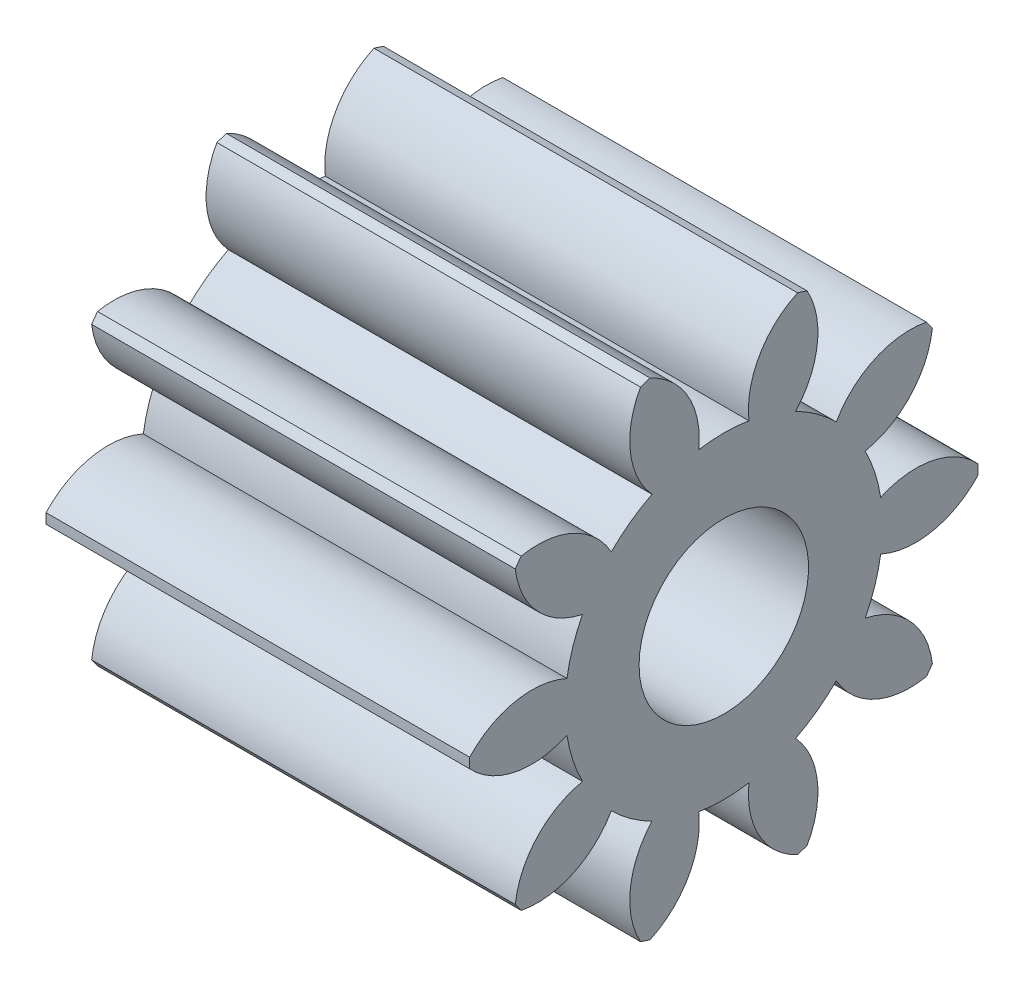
ISO-10303-21;
HEADER;
FILE_DESCRIPTION(('STEP AP214'),'2;1');
FILE_NAME('part.step','',(''),(''),'','','');
FILE_SCHEMA(('AUTOMOTIVE_DESIGN { 1 0 10303 214 1 1 1 1 }'));
ENDSEC;
DATA;
#1=APPLICATION_CONTEXT('core data for automotive mechanical design processes');
#2=APPLICATION_PROTOCOL_DEFINITION('international standard','automotive_design',2000,#1);
#3=PRODUCT_CONTEXT('',#1,'mechanical');
#4=PRODUCT('Part','Part','',(#3));
#5=PRODUCT_RELATED_PRODUCT_CATEGORY('part','',(#4));
#6=PRODUCT_DEFINITION_FORMATION('','',#4);
#7=PRODUCT_DEFINITION_CONTEXT('part definition',#1,'design');
#8=PRODUCT_DEFINITION('design','',#6,#7);
#9=PRODUCT_DEFINITION_SHAPE('','',#8);
#10=(LENGTH_UNIT() NAMED_UNIT(*) SI_UNIT(.MILLI.,.METRE.));
#11=(NAMED_UNIT(*) PLANE_ANGLE_UNIT() SI_UNIT($,.RADIAN.));
#12=(NAMED_UNIT(*) SI_UNIT($,.STERADIAN.) SOLID_ANGLE_UNIT());
#13=UNCERTAINTY_MEASURE_WITH_UNIT(LENGTH_MEASURE(1.E-05),#10,'distance_accuracy_value','');
#14=(GEOMETRIC_REPRESENTATION_CONTEXT(3) GLOBAL_UNCERTAINTY_ASSIGNED_CONTEXT((#13)) GLOBAL_UNIT_ASSIGNED_CONTEXT((#10,
#11,#12)) REPRESENTATION_CONTEXT('',''));
#15=CARTESIAN_POINT('',(0.,0.,0.));
#16=DIRECTION('',(0.,0.,1.));
#17=DIRECTION('',(1.,0.,0.));
#18=AXIS2_PLACEMENT_3D('',#15,#16,#17);
#19=CARTESIAN_POINT('',(5.,0.,0.));
#20=DIRECTION('',(-1.,0.,0.));
#21=DIRECTION('',(0.,0.,1.));
#22=AXIS2_PLACEMENT_3D('',#19,#20,#21);
#23=PLANE('',#22);
#24=CARTESIAN_POINT('',(5.,0.830089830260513,-2.19768964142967));
#25=DIRECTION('',(-1.,0.,0.));
#26=DIRECTION('',(0.,-0.587785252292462,-0.809016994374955));
#27=AXIS2_PLACEMENT_3D('',#24,#25,#26);
#28=CIRCLE('',#27,1.);
#29=CARTESIAN_POINT('',(5.,1.32275904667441,-1.32747297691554));
#30=VERTEX_POINT('',#29);
#31=CARTESIAN_POINT('',(5.,1.81110260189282,-2.39163278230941));
#32=VERTEX_POINT('',#31);
#33=EDGE_CURVE('E300',#30,#32,#28,.T.);
#34=ORIENTED_EDGE('',*,*,#33,.F.);
#35=CARTESIAN_POINT('',(5.,0.,0.));
#36=DIRECTION('',(-1.,0.,0.));
#37=DIRECTION('',(0.,-0.587785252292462,-0.809016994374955));
#38=AXIS2_PLACEMENT_3D('',#35,#36,#37);
#39=CIRCLE('',#38,1.874);
#40=CARTESIAN_POINT('',(5.,1.67125684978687,-0.84780690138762));
#41=VERTEX_POINT('',#40);
#42=EDGE_CURVE('E299',#41,#30,#39,.T.);
#43=ORIENTED_EDGE('',*,*,#42,.F.);
#44=CARTESIAN_POINT('',(5.,2.34663891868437,-0.110338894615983));
#45=DIRECTION('',(-1.,0.,0.));
#46=DIRECTION('',(0.,-0.587785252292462,-0.809016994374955));
#47=AXIS2_PLACEMENT_3D('',#44,#45,#46);
#48=CIRCLE('',#47,1.);
#49=CARTESIAN_POINT('',(5.,2.83423942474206,-0.983405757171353));
#50=VERTEX_POINT('',#49);
#51=EDGE_CURVE('E288',#50,#41,#48,.T.);
#52=ORIENTED_EDGE('',*,*,#51,.F.);
#53=CARTESIAN_POINT('',(5.,0.,0.));
#54=DIRECTION('',(-1.,0.,0.));
#55=DIRECTION('',(0.,0.,1.));
#56=AXIS2_PLACEMENT_3D('',#53,#54,#55);
#57=CIRCLE('',#56,3.);
#58=CARTESIAN_POINT('',(5.,2.87097926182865,-0.870332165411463));
#59=VERTEX_POINT('',#58);
#60=EDGE_CURVE('E523',#59,#50,#57,.T.);
#61=ORIENTED_EDGE('',*,*,#60,.F.);
#62=CARTESIAN_POINT('',(5.,1.96332633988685,-1.29005370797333));
#63=DIRECTION('',(-1.,0.,0.));
#64=DIRECTION('',(0.,0.,-1.));
#65=AXIS2_PLACEMENT_3D('',#62,#63,#64);
#66=CIRCLE('',#65,1.);
#67=CARTESIAN_POINT('',(5.,1.85040358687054,-0.296449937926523));
#68=VERTEX_POINT('',#67);
#69=EDGE_CURVE('E496',#68,#59,#66,.T.);
#70=ORIENTED_EDGE('',*,*,#69,.F.);
#71=CARTESIAN_POINT('',(5.,0.,0.));
#72=DIRECTION('',(-1.,0.,0.));
#73=DIRECTION('',(0.,0.,-1.));
#74=AXIS2_PLACEMENT_3D('',#71,#72,#73);
#75=CIRCLE('',#74,1.874);
#76=CARTESIAN_POINT('',(5.,1.85040358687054,0.296449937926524));
#77=VERTEX_POINT('',#76);
#78=EDGE_CURVE('E501',#77,#68,#75,.T.);
#79=ORIENTED_EDGE('',*,*,#78,.F.);
#80=CARTESIAN_POINT('',(5.,1.96332633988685,1.29005370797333));
#81=DIRECTION('',(-1.,0.,0.));
#82=DIRECTION('',(0.,0.,-1.));
#83=AXIS2_PLACEMENT_3D('',#80,#81,#82);
#84=CIRCLE('',#83,1.);
#85=CARTESIAN_POINT('',(5.,2.87097926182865,0.870332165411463));
#86=VERTEX_POINT('',#85);
#87=EDGE_CURVE('E498',#86,#77,#84,.T.);
#88=ORIENTED_EDGE('',*,*,#87,.F.);
#89=CARTESIAN_POINT('',(5.,2.83423942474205,0.983405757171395));
#90=VERTEX_POINT('',#89);
#91=EDGE_CURVE('E521',#90,#86,#57,.T.);
#92=ORIENTED_EDGE('',*,*,#91,.F.);
#93=CARTESIAN_POINT('',(5.,2.34663891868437,0.110338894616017));
#94=DIRECTION('',(-1.,0.,0.));
#95=DIRECTION('',(0.,0.587785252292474,-0.809016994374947));
#96=AXIS2_PLACEMENT_3D('',#93,#94,#95);
#97=CIRCLE('',#96,1.);
#98=CARTESIAN_POINT('',(5.,1.67125684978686,0.847806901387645));
#99=VERTEX_POINT('',#98);
#100=EDGE_CURVE('E474',#99,#90,#97,.T.);
#101=ORIENTED_EDGE('',*,*,#100,.F.);
#102=CARTESIAN_POINT('',(5.,0.,0.));
#103=DIRECTION('',(-1.,0.,0.));
#104=DIRECTION('',(0.,0.587785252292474,-0.809016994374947));
#105=AXIS2_PLACEMENT_3D('',#102,#103,#104);
#106=CIRCLE('',#105,1.874);
#107=CARTESIAN_POINT('',(5.,1.3227590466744,1.32747297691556));
#108=VERTEX_POINT('',#107);
#109=EDGE_CURVE('E479',#108,#99,#106,.T.);
#110=ORIENTED_EDGE('',*,*,#109,.F.);
#111=CARTESIAN_POINT('',(5.,0.830089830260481,2.19768964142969));
#112=DIRECTION('',(-1.,0.,0.));
#113=DIRECTION('',(0.,0.587785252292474,-0.809016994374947));
#114=AXIS2_PLACEMENT_3D('',#111,#112,#113);
#115=CIRCLE('',#114,1.);
#116=CARTESIAN_POINT('',(5.,1.81110260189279,2.39163278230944));
#117=VERTEX_POINT('',#116);
#118=EDGE_CURVE('E476',#117,#108,#115,.T.);
#119=ORIENTED_EDGE('',*,*,#118,.F.);
#120=CARTESIAN_POINT('',(5.,1.71491645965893,2.4615161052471));
#121=VERTEX_POINT('',#120);
#122=EDGE_CURVE('E589',#121,#117,#57,.T.);
#123=ORIENTED_EDGE('',*,*,#122,.F.);
#124=CARTESIAN_POINT('',(5.,1.83361518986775,1.46858578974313));
#125=DIRECTION('',(-1.,0.,0.));
#126=DIRECTION('',(0.,0.951056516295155,-0.309016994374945));
#127=AXIS2_PLACEMENT_3D('',#124,#125,#126);
#128=CIRCLE('',#127,1.);
#129=CARTESIAN_POINT('',(5.,0.853746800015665,1.66823032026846));
#130=VERTEX_POINT('',#129);
#131=EDGE_CURVE('E452',#130,#121,#128,.T.);
#132=ORIENTED_EDGE('',*,*,#131,.F.);
#133=CARTESIAN_POINT('',(5.,0.,0.));
#134=DIRECTION('',(-1.,0.,0.));
#135=DIRECTION('',(0.,0.951056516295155,-0.309016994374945));
#136=AXIS2_PLACEMENT_3D('',#133,#134,#135);
#137=CIRCLE('',#136,1.874);
#138=CARTESIAN_POINT('',(5.,0.289865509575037,1.85144645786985));
#139=VERTEX_POINT('',#138);
#140=EDGE_CURVE('E457',#139,#130,#137,.T.);
#141=ORIENTED_EDGE('',*,*,#140,.F.);
#142=CARTESIAN_POINT('',(5.,-0.620212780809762,2.26588282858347));
#143=DIRECTION('',(-1.,0.,0.));
#144=DIRECTION('',(0.,0.951056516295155,-0.309016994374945));
#145=AXIS2_PLACEMENT_3D('',#142,#143,#144);
#146=CIRCLE('',#145,1.);
#147=CARTESIAN_POINT('',(5.,0.0594463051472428,2.99941096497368));
#148=VERTEX_POINT('',#147);
#149=EDGE_CURVE('E454',#148,#139,#146,.T.);
#150=ORIENTED_EDGE('',*,*,#149,.F.);
#151=CARTESIAN_POINT('',(5.,-0.0594463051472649,2.99941096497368));
#152=VERTEX_POINT('',#151);
#153=EDGE_CURVE('E584',#152,#148,#57,.T.);
#154=ORIENTED_EDGE('',*,*,#153,.F.);
#155=CARTESIAN_POINT('',(5.,0.620212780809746,2.26588282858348));
#156=DIRECTION('',(-1.,0.,0.));
#157=DIRECTION('',(0.,0.951056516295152,0.309016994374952));
#158=AXIS2_PLACEMENT_3D('',#155,#156,#157);
#159=CIRCLE('',#158,1.);
#160=CARTESIAN_POINT('',(5.,-0.28986550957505,1.85144645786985));
#161=VERTEX_POINT('',#160);
#162=EDGE_CURVE('E430',#161,#152,#159,.T.);
#163=ORIENTED_EDGE('',*,*,#162,.F.);
#164=CARTESIAN_POINT('',(5.,0.,0.));
#165=DIRECTION('',(-1.,0.,0.));
#166=DIRECTION('',(0.,0.951056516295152,0.309016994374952));
#167=AXIS2_PLACEMENT_3D('',#164,#165,#166);
#168=CIRCLE('',#167,1.874);
#169=CARTESIAN_POINT('',(5.,-0.853746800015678,1.66823032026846));
#170=VERTEX_POINT('',#169);
#171=EDGE_CURVE('E435',#170,#161,#168,.T.);
#172=ORIENTED_EDGE('',*,*,#171,.F.);
#173=CARTESIAN_POINT('',(5.,-1.83361518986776,1.46858578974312));
#174=DIRECTION('',(-1.,0.,0.));
#175=DIRECTION('',(0.,0.951056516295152,0.309016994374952));
#176=AXIS2_PLACEMENT_3D('',#173,#174,#175);
#177=CIRCLE('',#176,1.);
#178=CARTESIAN_POINT('',(5.,-1.71491645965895,2.46151610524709));
#179=VERTEX_POINT('',#178);
#180=EDGE_CURVE('E432',#179,#170,#177,.T.);
#181=ORIENTED_EDGE('',*,*,#180,.F.);
#182=CARTESIAN_POINT('',(5.,-1.8111026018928,2.39163278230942));
#183=VERTEX_POINT('',#182);
#184=EDGE_CURVE('E579',#183,#179,#57,.T.);
#185=ORIENTED_EDGE('',*,*,#184,.F.);
#186=CARTESIAN_POINT('',(5.,-0.830089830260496,2.19768964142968));
#187=DIRECTION('',(-1.,0.,0.));
#188=DIRECTION('',(0.,0.587785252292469,0.809016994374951));
#189=AXIS2_PLACEMENT_3D('',#186,#187,#188);
#190=CIRCLE('',#189,1.);
#191=CARTESIAN_POINT('',(5.,-1.3227590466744,1.32747297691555));
#192=VERTEX_POINT('',#191);
#193=EDGE_CURVE('E408',#192,#183,#190,.T.);
#194=ORIENTED_EDGE('',*,*,#193,.F.);
#195=CARTESIAN_POINT('',(5.,0.,0.));
#196=DIRECTION('',(-1.,0.,0.));
#197=DIRECTION('',(0.,0.587785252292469,0.809016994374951));
#198=AXIS2_PLACEMENT_3D('',#195,#196,#197);
#199=CIRCLE('',#198,1.874);
#200=CARTESIAN_POINT('',(5.,-1.67125684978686,0.847806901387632));
#201=VERTEX_POINT('',#200);
#202=EDGE_CURVE('E413',#201,#192,#199,.T.);
#203=ORIENTED_EDGE('',*,*,#202,.F.);
#204=CARTESIAN_POINT('',(5.,-2.34663891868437,0.110338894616));
#205=DIRECTION('',(-1.,0.,0.));
#206=DIRECTION('',(0.,0.587785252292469,0.809016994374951));
#207=AXIS2_PLACEMENT_3D('',#204,#205,#206);
#208=CIRCLE('',#207,1.);
#209=CARTESIAN_POINT('',(5.,-2.83423942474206,0.983405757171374));
#210=VERTEX_POINT('',#209);
#211=EDGE_CURVE('E410',#210,#201,#208,.T.);
#212=ORIENTED_EDGE('',*,*,#211,.F.);
#213=CARTESIAN_POINT('',(5.,-2.87097926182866,0.870332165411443));
#214=VERTEX_POINT('',#213);
#215=EDGE_CURVE('E574',#214,#210,#57,.T.);
#216=ORIENTED_EDGE('',*,*,#215,.F.);
#217=CARTESIAN_POINT('',(5.,-1.96332633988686,1.29005370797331));
#218=DIRECTION('',(-1.,0.,0.));
#219=DIRECTION('',(0.,0.,1.));
#220=AXIS2_PLACEMENT_3D('',#217,#218,#219);
#221=CIRCLE('',#220,1.);
#222=CARTESIAN_POINT('',(5.,-1.85040358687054,0.29644993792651));
#223=VERTEX_POINT('',#222);
#224=EDGE_CURVE('E386',#223,#214,#221,.T.);
#225=ORIENTED_EDGE('',*,*,#224,.F.);
#226=CARTESIAN_POINT('',(5.,0.,0.));
#227=DIRECTION('',(-1.,0.,0.));
#228=DIRECTION('',(0.,0.,1.));
#229=AXIS2_PLACEMENT_3D('',#226,#227,#228);
#230=CIRCLE('',#229,1.874);
#231=CARTESIAN_POINT('',(5.,-1.85040358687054,-0.296449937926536));
#232=VERTEX_POINT('',#231);
#233=EDGE_CURVE('E391',#232,#223,#230,.T.);
#234=ORIENTED_EDGE('',*,*,#233,.F.);
#235=CARTESIAN_POINT('',(5.,-1.96332633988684,-1.29005370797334));
#236=DIRECTION('',(-1.,0.,0.));
#237=DIRECTION('',(0.,0.,1.));
#238=AXIS2_PLACEMENT_3D('',#235,#236,#237);
#239=CIRCLE('',#238,1.);
#240=CARTESIAN_POINT('',(5.,-2.87097926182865,-0.870332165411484));
#241=VERTEX_POINT('',#240);
#242=EDGE_CURVE('E388',#241,#232,#239,.T.);
#243=ORIENTED_EDGE('',*,*,#242,.F.);
#244=CARTESIAN_POINT('',(5.,-2.83423942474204,-0.983405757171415));
#245=VERTEX_POINT('',#244);
#246=EDGE_CURVE('E569',#245,#241,#57,.T.);
#247=ORIENTED_EDGE('',*,*,#246,.F.);
#248=CARTESIAN_POINT('',(5.,-2.34663891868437,-0.110338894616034));
#249=DIRECTION('',(-1.,0.,0.));
#250=DIRECTION('',(0.,-0.58778525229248,0.809016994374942));
#251=AXIS2_PLACEMENT_3D('',#248,#249,#250);
#252=CIRCLE('',#251,1.);
#253=CARTESIAN_POINT('',(5.,-1.67125684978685,-0.847806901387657));
#254=VERTEX_POINT('',#253);
#255=EDGE_CURVE('E364',#254,#245,#252,.T.);
#256=ORIENTED_EDGE('',*,*,#255,.F.);
#257=CARTESIAN_POINT('',(5.,0.,0.));
#258=DIRECTION('',(-1.,0.,0.));
#259=DIRECTION('',(0.,-0.58778525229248,0.809016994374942));
#260=AXIS2_PLACEMENT_3D('',#257,#258,#259);
#261=CIRCLE('',#260,1.874);
#262=CARTESIAN_POINT('',(5.,-1.32275904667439,-1.32747297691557));
#263=VERTEX_POINT('',#262);
#264=EDGE_CURVE('E369',#263,#254,#261,.T.);
#265=ORIENTED_EDGE('',*,*,#264,.F.);
#266=CARTESIAN_POINT('',(5.,-0.830089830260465,-2.19768964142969));
#267=DIRECTION('',(-1.,0.,0.));
#268=DIRECTION('',(0.,-0.58778525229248,0.809016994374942));
#269=AXIS2_PLACEMENT_3D('',#266,#267,#268);
#270=CIRCLE('',#269,1.);
#271=CARTESIAN_POINT('',(5.,-1.81110260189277,-2.39163278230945));
#272=VERTEX_POINT('',#271);
#273=EDGE_CURVE('E366',#272,#263,#270,.T.);
#274=ORIENTED_EDGE('',*,*,#273,.F.);
#275=CARTESIAN_POINT('',(5.,-1.71491645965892,-2.46151610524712));
#276=VERTEX_POINT('',#275);
#277=EDGE_CURVE('E564',#276,#272,#57,.T.);
#278=ORIENTED_EDGE('',*,*,#277,.F.);
#279=CARTESIAN_POINT('',(5.,-1.83361518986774,-1.46858578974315));
#280=DIRECTION('',(-1.,0.,0.));
#281=DIRECTION('',(0.,-0.951056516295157,0.309016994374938));
#282=AXIS2_PLACEMENT_3D('',#279,#280,#281);
#283=CIRCLE('',#282,1.);
#284=CARTESIAN_POINT('',(5.,-0.853746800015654,-1.66823032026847));
#285=VERTEX_POINT('',#284);
#286=EDGE_CURVE('E342',#285,#276,#283,.T.);
#287=ORIENTED_EDGE('',*,*,#286,.F.);
#288=CARTESIAN_POINT('',(5.,0.,0.));
#289=DIRECTION('',(-1.,0.,0.));
#290=DIRECTION('',(0.,-0.951056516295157,0.309016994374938));
#291=AXIS2_PLACEMENT_3D('',#288,#289,#290);
#292=CIRCLE('',#291,1.874);
#293=CARTESIAN_POINT('',(5.,-0.289865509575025,-1.85144645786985));
#294=VERTEX_POINT('',#293);
#295=EDGE_CURVE('E347',#294,#285,#292,.T.);
#296=ORIENTED_EDGE('',*,*,#295,.F.);
#297=CARTESIAN_POINT('',(5.,0.620212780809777,-2.26588282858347));
#298=DIRECTION('',(-1.,0.,0.));
#299=DIRECTION('',(0.,-0.951056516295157,0.309016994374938));
#300=AXIS2_PLACEMENT_3D('',#297,#298,#299);
#301=CIRCLE('',#300,1.);
#302=CARTESIAN_POINT('',(5.,-0.0594463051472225,-2.99941096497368));
#303=VERTEX_POINT('',#302);
#304=EDGE_CURVE('E344',#303,#294,#301,.T.);
#305=ORIENTED_EDGE('',*,*,#304,.F.);
#306=CARTESIAN_POINT('',(5.,0.0594463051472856,-2.99941096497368));
#307=VERTEX_POINT('',#306);
#308=EDGE_CURVE('E563',#307,#303,#57,.T.);
#309=ORIENTED_EDGE('',*,*,#308,.F.);
#310=CARTESIAN_POINT('',(5.,-0.62021278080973,-2.26588282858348));
#311=DIRECTION('',(-1.,0.,0.));
#312=DIRECTION('',(0.,-0.95105651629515,-0.309016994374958));
#313=AXIS2_PLACEMENT_3D('',#310,#311,#312);
#314=CIRCLE('',#313,1.);
#315=CARTESIAN_POINT('',(5.,0.289865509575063,-1.85144645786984));
#316=VERTEX_POINT('',#315);
#317=EDGE_CURVE('E322',#316,#307,#314,.T.);
#318=ORIENTED_EDGE('',*,*,#317,.F.);
#319=CARTESIAN_POINT('',(5.,0.,0.));
#320=DIRECTION('',(-1.,0.,0.));
#321=DIRECTION('',(0.,-0.95105651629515,-0.309016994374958));
#322=AXIS2_PLACEMENT_3D('',#319,#320,#321);
#323=CIRCLE('',#322,1.874);
#324=CARTESIAN_POINT('',(5.,0.853746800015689,-1.66823032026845));
#325=VERTEX_POINT('',#324);
#326=EDGE_CURVE('E327',#325,#316,#323,.T.);
#327=ORIENTED_EDGE('',*,*,#326,.F.);
#328=CARTESIAN_POINT('',(5.,1.83361518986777,-1.46858578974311));
#329=DIRECTION('',(-1.,0.,0.));
#330=DIRECTION('',(0.,-0.95105651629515,-0.309016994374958));
#331=AXIS2_PLACEMENT_3D('',#328,#329,#330);
#332=CIRCLE('',#331,1.);
#333=CARTESIAN_POINT('',(5.,1.71491645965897,-2.46151610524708));
#334=VERTEX_POINT('',#333);
#335=EDGE_CURVE('E324',#334,#325,#332,.T.);
#336=ORIENTED_EDGE('',*,*,#335,.F.);
#337=EDGE_CURVE('E526',#32,#334,#57,.T.);
#338=ORIENTED_EDGE('',*,*,#337,.F.);
#339=EDGE_LOOP('',(#34,#43,#52,#61,#70,#79,#88,#92,#101,#110,#119,#123,#132,#141,#150,#154,#163,
#172,#181,#185,#194,#203,#212,#216,#225,#234,#243,#247,#256,#265,#274,#278,#287,#296,#305,#309,
#318,#327,#336,#338));
#340=FACE_BOUND('',#339,.T.);
#341=CARTESIAN_POINT('',(5.,0.,0.));
#342=DIRECTION('',(-1.,0.,0.));
#343=DIRECTION('',(0.,0.,1.));
#344=AXIS2_PLACEMENT_3D('',#341,#342,#343);
#345=CIRCLE('',#344,1.);
#346=CARTESIAN_POINT('',(5.,0.,1.));
#347=VERTEX_POINT('',#346);
#348=EDGE_CURVE('E317',#347,#347,#345,.F.);
#349=ORIENTED_EDGE('',*,*,#348,.F.);
#350=EDGE_LOOP('',(#349));
#351=FACE_BOUND('',#350,.T.);
#352=ADVANCED_FACE('F31',(#340,#351),#23,.F.);
#353=CARTESIAN_POINT('',(0.,0.,0.));
#354=DIRECTION('',(1.,0.,0.));
#355=DIRECTION('',(0.,0.,-1.));
#356=AXIS2_PLACEMENT_3D('',#353,#354,#355);
#357=PLANE('',#356);
#358=CARTESIAN_POINT('',(0.,0.830089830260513,-2.19768964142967));
#359=DIRECTION('',(-1.,0.,0.));
#360=DIRECTION('',(0.,-0.587785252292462,-0.809016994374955));
#361=AXIS2_PLACEMENT_3D('',#358,#359,#360);
#362=CIRCLE('',#361,1.);
#363=CARTESIAN_POINT('',(0.,1.32275904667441,-1.32747297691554));
#364=VERTEX_POINT('',#363);
#365=CARTESIAN_POINT('',(0.,1.81110260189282,-2.39163278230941));
#366=VERTEX_POINT('',#365);
#367=EDGE_CURVE('E46',#364,#366,#362,.T.);
#368=ORIENTED_EDGE('',*,*,#367,.T.);
#369=CARTESIAN_POINT('',(0.,0.,0.));
#370=DIRECTION('',(-1.,0.,0.));
#371=DIRECTION('',(0.,0.,1.));
#372=AXIS2_PLACEMENT_3D('',#369,#370,#371);
#373=CIRCLE('',#372,3.);
#374=CARTESIAN_POINT('',(0.,1.71491645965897,-2.46151610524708));
#375=VERTEX_POINT('',#374);
#376=EDGE_CURVE('E522',#366,#375,#373,.T.);
#377=ORIENTED_EDGE('',*,*,#376,.T.);
#378=CARTESIAN_POINT('',(0.,1.83361518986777,-1.46858578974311));
#379=DIRECTION('',(1.,0.,0.));
#380=DIRECTION('',(0.,0.,-1.));
#381=AXIS2_PLACEMENT_3D('',#378,#379,#380);
#382=CIRCLE('',#381,1.);
#383=CARTESIAN_POINT('',(0.,0.853746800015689,-1.66823032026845));
#384=VERTEX_POINT('',#383);
#385=EDGE_CURVE('E39',#384,#375,#382,.T.);
#386=ORIENTED_EDGE('',*,*,#385,.F.);
#387=CARTESIAN_POINT('',(0.,0.,0.));
#388=DIRECTION('',(-1.,0.,0.));
#389=DIRECTION('',(0.,-0.95105651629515,-0.309016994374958));
#390=AXIS2_PLACEMENT_3D('',#387,#388,#389);
#391=CIRCLE('',#390,1.874);
#392=CARTESIAN_POINT('',(0.,0.289865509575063,-1.85144645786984));
#393=VERTEX_POINT('',#392);
#394=EDGE_CURVE('E325',#384,#393,#391,.T.);
#395=ORIENTED_EDGE('',*,*,#394,.T.);
#396=CARTESIAN_POINT('',(0.,-0.62021278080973,-2.26588282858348));
#397=DIRECTION('',(-1.,0.,0.));
#398=DIRECTION('',(0.,-0.95105651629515,-0.309016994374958));
#399=AXIS2_PLACEMENT_3D('',#396,#397,#398);
#400=CIRCLE('',#399,1.);
#401=CARTESIAN_POINT('',(0.,0.059446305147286,-2.99941096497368));
#402=VERTEX_POINT('',#401);
#403=EDGE_CURVE('E54',#393,#402,#400,.T.);
#404=ORIENTED_EDGE('',*,*,#403,.T.);
#405=CARTESIAN_POINT('',(0.,-0.059446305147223,-2.99941096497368));
#406=VERTEX_POINT('',#405);
#407=EDGE_CURVE('E756',#402,#406,#373,.T.);
#408=ORIENTED_EDGE('',*,*,#407,.T.);
#409=CARTESIAN_POINT('',(0.,0.620212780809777,-2.26588282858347));
#410=DIRECTION('',(1.,0.,0.));
#411=DIRECTION('',(0.,0.,-1.));
#412=AXIS2_PLACEMENT_3D('',#409,#410,#411);
#413=CIRCLE('',#412,1.);
#414=CARTESIAN_POINT('',(0.,-0.289865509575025,-1.85144645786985));
#415=VERTEX_POINT('',#414);
#416=EDGE_CURVE('E547',#415,#406,#413,.T.);
#417=ORIENTED_EDGE('',*,*,#416,.F.);
#418=CARTESIAN_POINT('',(0.,0.,0.));
#419=DIRECTION('',(-1.,0.,0.));
#420=DIRECTION('',(0.,-0.951056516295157,0.309016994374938));
#421=AXIS2_PLACEMENT_3D('',#418,#419,#420);
#422=CIRCLE('',#421,1.874);
#423=CARTESIAN_POINT('',(0.,-0.853746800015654,-1.66823032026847));
#424=VERTEX_POINT('',#423);
#425=EDGE_CURVE('E345',#415,#424,#422,.T.);
#426=ORIENTED_EDGE('',*,*,#425,.T.);
#427=CARTESIAN_POINT('',(0.,-1.83361518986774,-1.46858578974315));
#428=DIRECTION('',(-1.,0.,0.));
#429=DIRECTION('',(0.,-0.951056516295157,0.309016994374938));
#430=AXIS2_PLACEMENT_3D('',#427,#428,#429);
#431=CIRCLE('',#430,1.);
#432=CARTESIAN_POINT('',(0.,-1.71491645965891,-2.46151610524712));
#433=VERTEX_POINT('',#432);
#434=EDGE_CURVE('E341',#424,#433,#431,.T.);
#435=ORIENTED_EDGE('',*,*,#434,.T.);
#436=CARTESIAN_POINT('',(0.,-1.81110260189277,-2.39163278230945));
#437=VERTEX_POINT('',#436);
#438=EDGE_CURVE('E757',#433,#437,#373,.T.);
#439=ORIENTED_EDGE('',*,*,#438,.T.);
#440=CARTESIAN_POINT('',(0.,-0.830089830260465,-2.19768964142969));
#441=DIRECTION('',(1.,0.,0.));
#442=DIRECTION('',(0.,0.,-1.));
#443=AXIS2_PLACEMENT_3D('',#440,#441,#442);
#444=CIRCLE('',#443,1.);
#445=CARTESIAN_POINT('',(0.,-1.32275904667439,-1.32747297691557));
#446=VERTEX_POINT('',#445);
#447=EDGE_CURVE('E544',#446,#437,#444,.T.);
#448=ORIENTED_EDGE('',*,*,#447,.F.);
#449=CARTESIAN_POINT('',(0.,0.,0.));
#450=DIRECTION('',(-1.,0.,0.));
#451=DIRECTION('',(0.,-0.58778525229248,0.809016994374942));
#452=AXIS2_PLACEMENT_3D('',#449,#450,#451);
#453=CIRCLE('',#452,1.874);
#454=CARTESIAN_POINT('',(0.,-1.67125684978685,-0.847806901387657));
#455=VERTEX_POINT('',#454);
#456=EDGE_CURVE('E367',#446,#455,#453,.T.);
#457=ORIENTED_EDGE('',*,*,#456,.T.);
#458=CARTESIAN_POINT('',(0.,-2.34663891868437,-0.110338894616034));
#459=DIRECTION('',(-1.,0.,0.));
#460=DIRECTION('',(0.,-0.58778525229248,0.809016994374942));
#461=AXIS2_PLACEMENT_3D('',#458,#459,#460);
#462=CIRCLE('',#461,1.);
#463=CARTESIAN_POINT('',(0.,-2.83423942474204,-0.983405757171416));
#464=VERTEX_POINT('',#463);
#465=EDGE_CURVE('E363',#455,#464,#462,.T.);
#466=ORIENTED_EDGE('',*,*,#465,.T.);
#467=CARTESIAN_POINT('',(0.,-2.87097926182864,-0.870332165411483));
#468=VERTEX_POINT('',#467);
#469=EDGE_CURVE('E760',#464,#468,#373,.T.);
#470=ORIENTED_EDGE('',*,*,#469,.T.);
#471=CARTESIAN_POINT('',(0.,-1.96332633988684,-1.29005370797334));
#472=DIRECTION('',(1.,0.,0.));
#473=DIRECTION('',(0.,0.,-1.));
#474=AXIS2_PLACEMENT_3D('',#471,#472,#473);
#475=CIRCLE('',#474,1.);
#476=CARTESIAN_POINT('',(0.,-1.85040358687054,-0.296449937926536));
#477=VERTEX_POINT('',#476);
#478=EDGE_CURVE('E541',#477,#468,#475,.T.);
#479=ORIENTED_EDGE('',*,*,#478,.F.);
#480=CARTESIAN_POINT('',(0.,0.,0.));
#481=DIRECTION('',(-1.,0.,0.));
#482=DIRECTION('',(0.,0.,1.));
#483=AXIS2_PLACEMENT_3D('',#480,#481,#482);
#484=CIRCLE('',#483,1.874);
#485=CARTESIAN_POINT('',(0.,-1.85040358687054,0.29644993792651));
#486=VERTEX_POINT('',#485);
#487=EDGE_CURVE('E389',#477,#486,#484,.T.);
#488=ORIENTED_EDGE('',*,*,#487,.T.);
#489=CARTESIAN_POINT('',(0.,-1.96332633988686,1.29005370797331));
#490=DIRECTION('',(-1.,0.,0.));
#491=DIRECTION('',(0.,0.,1.));
#492=AXIS2_PLACEMENT_3D('',#489,#490,#491);
#493=CIRCLE('',#492,1.);
#494=CARTESIAN_POINT('',(0.,-2.87097926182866,0.870332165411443));
#495=VERTEX_POINT('',#494);
#496=EDGE_CURVE('E385',#486,#495,#493,.T.);
#497=ORIENTED_EDGE('',*,*,#496,.T.);
#498=CARTESIAN_POINT('',(0.,-2.83423942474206,0.983405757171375));
#499=VERTEX_POINT('',#498);
#500=EDGE_CURVE('E763',#495,#499,#373,.T.);
#501=ORIENTED_EDGE('',*,*,#500,.T.);
#502=CARTESIAN_POINT('',(0.,-2.34663891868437,0.110338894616));
#503=DIRECTION('',(1.,0.,0.));
#504=DIRECTION('',(0.,0.,-1.));
#505=AXIS2_PLACEMENT_3D('',#502,#503,#504);
#506=CIRCLE('',#505,1.);
#507=CARTESIAN_POINT('',(0.,-1.67125684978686,0.847806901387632));
#508=VERTEX_POINT('',#507);
#509=EDGE_CURVE('E538',#508,#499,#506,.T.);
#510=ORIENTED_EDGE('',*,*,#509,.F.);
#511=CARTESIAN_POINT('',(0.,0.,0.));
#512=DIRECTION('',(-1.,0.,0.));
#513=DIRECTION('',(0.,0.587785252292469,0.809016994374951));
#514=AXIS2_PLACEMENT_3D('',#511,#512,#513);
#515=CIRCLE('',#514,1.874);
#516=CARTESIAN_POINT('',(0.,-1.3227590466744,1.32747297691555));
#517=VERTEX_POINT('',#516);
#518=EDGE_CURVE('E411',#508,#517,#515,.T.);
#519=ORIENTED_EDGE('',*,*,#518,.T.);
#520=CARTESIAN_POINT('',(0.,-0.830089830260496,2.19768964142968));
#521=DIRECTION('',(-1.,0.,0.));
#522=DIRECTION('',(0.,0.587785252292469,0.809016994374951));
#523=AXIS2_PLACEMENT_3D('',#520,#521,#522);
#524=CIRCLE('',#523,1.);
#525=CARTESIAN_POINT('',(0.,-1.8111026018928,2.39163278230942));
#526=VERTEX_POINT('',#525);
#527=EDGE_CURVE('E407',#517,#526,#524,.T.);
#528=ORIENTED_EDGE('',*,*,#527,.T.);
#529=CARTESIAN_POINT('',(0.,-1.71491645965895,2.46151610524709));
#530=VERTEX_POINT('',#529);
#531=EDGE_CURVE('E766',#526,#530,#373,.T.);
#532=ORIENTED_EDGE('',*,*,#531,.T.);
#533=CARTESIAN_POINT('',(0.,-1.83361518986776,1.46858578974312));
#534=DIRECTION('',(1.,0.,0.));
#535=DIRECTION('',(0.,0.,-1.));
#536=AXIS2_PLACEMENT_3D('',#533,#534,#535);
#537=CIRCLE('',#536,1.);
#538=CARTESIAN_POINT('',(0.,-0.853746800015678,1.66823032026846));
#539=VERTEX_POINT('',#538);
#540=EDGE_CURVE('E535',#539,#530,#537,.T.);
#541=ORIENTED_EDGE('',*,*,#540,.F.);
#542=CARTESIAN_POINT('',(0.,0.,0.));
#543=DIRECTION('',(-1.,0.,0.));
#544=DIRECTION('',(0.,0.951056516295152,0.309016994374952));
#545=AXIS2_PLACEMENT_3D('',#542,#543,#544);
#546=CIRCLE('',#545,1.874);
#547=CARTESIAN_POINT('',(0.,-0.28986550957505,1.85144645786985));
#548=VERTEX_POINT('',#547);
#549=EDGE_CURVE('E433',#539,#548,#546,.T.);
#550=ORIENTED_EDGE('',*,*,#549,.T.);
#551=CARTESIAN_POINT('',(0.,0.620212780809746,2.26588282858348));
#552=DIRECTION('',(-1.,0.,0.));
#553=DIRECTION('',(0.,0.951056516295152,0.309016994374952));
#554=AXIS2_PLACEMENT_3D('',#551,#552,#553);
#555=CIRCLE('',#554,1.);
#556=CARTESIAN_POINT('',(0.,-0.059446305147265,2.99941096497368));
#557=VERTEX_POINT('',#556);
#558=EDGE_CURVE('E429',#548,#557,#555,.T.);
#559=ORIENTED_EDGE('',*,*,#558,.T.);
#560=CARTESIAN_POINT('',(0.,0.0594463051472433,2.99941096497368));
#561=VERTEX_POINT('',#560);
#562=EDGE_CURVE('E769',#557,#561,#373,.T.);
#563=ORIENTED_EDGE('',*,*,#562,.T.);
#564=CARTESIAN_POINT('',(0.,-0.620212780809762,2.26588282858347));
#565=DIRECTION('',(1.,0.,0.));
#566=DIRECTION('',(0.,0.,-1.));
#567=AXIS2_PLACEMENT_3D('',#564,#565,#566);
#568=CIRCLE('',#567,1.);
#569=CARTESIAN_POINT('',(0.,0.289865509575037,1.85144645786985));
#570=VERTEX_POINT('',#569);
#571=EDGE_CURVE('E532',#570,#561,#568,.T.);
#572=ORIENTED_EDGE('',*,*,#571,.F.);
#573=CARTESIAN_POINT('',(0.,0.,0.));
#574=DIRECTION('',(-1.,0.,0.));
#575=DIRECTION('',(0.,0.951056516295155,-0.309016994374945));
#576=AXIS2_PLACEMENT_3D('',#573,#574,#575);
#577=CIRCLE('',#576,1.874);
#578=CARTESIAN_POINT('',(0.,0.853746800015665,1.66823032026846));
#579=VERTEX_POINT('',#578);
#580=EDGE_CURVE('E455',#570,#579,#577,.T.);
#581=ORIENTED_EDGE('',*,*,#580,.T.);
#582=CARTESIAN_POINT('',(0.,1.83361518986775,1.46858578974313));
#583=DIRECTION('',(-1.,0.,0.));
#584=DIRECTION('',(0.,0.951056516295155,-0.309016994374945));
#585=AXIS2_PLACEMENT_3D('',#582,#583,#584);
#586=CIRCLE('',#585,1.);
#587=CARTESIAN_POINT('',(0.,1.71491645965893,2.4615161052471));
#588=VERTEX_POINT('',#587);
#589=EDGE_CURVE('E451',#579,#588,#586,.T.);
#590=ORIENTED_EDGE('',*,*,#589,.T.);
#591=CARTESIAN_POINT('',(0.,1.81110260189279,2.39163278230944));
#592=VERTEX_POINT('',#591);
#593=EDGE_CURVE('E772',#588,#592,#373,.T.);
#594=ORIENTED_EDGE('',*,*,#593,.T.);
#595=CARTESIAN_POINT('',(0.,0.830089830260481,2.19768964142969));
#596=DIRECTION('',(1.,0.,0.));
#597=DIRECTION('',(0.,0.,-1.));
#598=AXIS2_PLACEMENT_3D('',#595,#596,#597);
#599=CIRCLE('',#598,1.);
#600=CARTESIAN_POINT('',(0.,1.3227590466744,1.32747297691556));
#601=VERTEX_POINT('',#600);
#602=EDGE_CURVE('E529',#601,#592,#599,.T.);
#603=ORIENTED_EDGE('',*,*,#602,.F.);
#604=CARTESIAN_POINT('',(0.,0.,0.));
#605=DIRECTION('',(-1.,0.,0.));
#606=DIRECTION('',(0.,0.587785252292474,-0.809016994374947));
#607=AXIS2_PLACEMENT_3D('',#604,#605,#606);
#608=CIRCLE('',#607,1.874);
#609=CARTESIAN_POINT('',(0.,1.67125684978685,0.847806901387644));
#610=VERTEX_POINT('',#609);
#611=EDGE_CURVE('E477',#601,#610,#608,.T.);
#612=ORIENTED_EDGE('',*,*,#611,.T.);
#613=CARTESIAN_POINT('',(0.,2.34663891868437,0.110338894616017));
#614=DIRECTION('',(-1.,0.,0.));
#615=DIRECTION('',(0.,0.587785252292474,-0.809016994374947));
#616=AXIS2_PLACEMENT_3D('',#613,#614,#615);
#617=CIRCLE('',#616,1.);
#618=CARTESIAN_POINT('',(0.,2.83423942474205,0.983405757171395));
#619=VERTEX_POINT('',#618);
#620=EDGE_CURVE('E473',#610,#619,#617,.T.);
#621=ORIENTED_EDGE('',*,*,#620,.T.);
#622=CARTESIAN_POINT('',(0.,2.87097926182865,0.870332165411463));
#623=VERTEX_POINT('',#622);
#624=EDGE_CURVE('E517',#619,#623,#373,.T.);
#625=ORIENTED_EDGE('',*,*,#624,.T.);
#626=CARTESIAN_POINT('',(0.,1.96332633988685,1.29005370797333));
#627=DIRECTION('',(1.,0.,0.));
#628=DIRECTION('',(0.,0.,-1.));
#629=AXIS2_PLACEMENT_3D('',#626,#627,#628);
#630=CIRCLE('',#629,1.);
#631=CARTESIAN_POINT('',(0.,1.85040358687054,0.296449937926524));
#632=VERTEX_POINT('',#631);
#633=EDGE_CURVE('E525',#632,#623,#630,.T.);
#634=ORIENTED_EDGE('',*,*,#633,.F.);
#635=CARTESIAN_POINT('',(0.,0.,0.));
#636=DIRECTION('',(-1.,0.,0.));
#637=DIRECTION('',(0.,0.,-1.));
#638=AXIS2_PLACEMENT_3D('',#635,#636,#637);
#639=CIRCLE('',#638,1.874);
#640=CARTESIAN_POINT('',(0.,1.85040358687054,-0.296449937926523));
#641=VERTEX_POINT('',#640);
#642=EDGE_CURVE('E499',#632,#641,#639,.T.);
#643=ORIENTED_EDGE('',*,*,#642,.T.);
#644=CARTESIAN_POINT('',(0.,1.96332633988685,-1.29005370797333));
#645=DIRECTION('',(-1.,0.,0.));
#646=DIRECTION('',(0.,0.,-1.));
#647=AXIS2_PLACEMENT_3D('',#644,#645,#646);
#648=CIRCLE('',#647,1.);
#649=CARTESIAN_POINT('',(0.,2.87097926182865,-0.870332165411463));
#650=VERTEX_POINT('',#649);
#651=EDGE_CURVE('E495',#641,#650,#648,.T.);
#652=ORIENTED_EDGE('',*,*,#651,.T.);
#653=CARTESIAN_POINT('',(0.,2.83423942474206,-0.983405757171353));
#654=VERTEX_POINT('',#653);
#655=EDGE_CURVE('E518',#650,#654,#373,.T.);
#656=ORIENTED_EDGE('',*,*,#655,.T.);
#657=CARTESIAN_POINT('',(0.,2.34663891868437,-0.110338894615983));
#658=DIRECTION('',(1.,0.,0.));
#659=DIRECTION('',(0.,0.,-1.));
#660=AXIS2_PLACEMENT_3D('',#657,#658,#659);
#661=CIRCLE('',#660,1.);
#662=CARTESIAN_POINT('',(0.,1.67125684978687,-0.84780690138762));
#663=VERTEX_POINT('',#662);
#664=EDGE_CURVE('E11',#663,#654,#661,.T.);
#665=ORIENTED_EDGE('',*,*,#664,.F.);
#666=CARTESIAN_POINT('',(0.,0.,0.));
#667=DIRECTION('',(-1.,0.,0.));
#668=DIRECTION('',(0.,-0.587785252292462,-0.809016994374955));
#669=AXIS2_PLACEMENT_3D('',#666,#667,#668);
#670=CIRCLE('',#669,1.874);
#671=EDGE_CURVE('E305',#663,#364,#670,.T.);
#672=ORIENTED_EDGE('',*,*,#671,.T.);
#673=EDGE_LOOP('',(#368,#377,#386,#395,#404,#408,#417,#426,#435,#439,#448,#457,#466,#470,#479,
#488,#497,#501,#510,#519,#528,#532,#541,#550,#559,#563,#572,#581,#590,#594,#603,#612,#621,#625,
#634,#643,#652,#656,#665,#672));
#674=FACE_BOUND('',#673,.T.);
#675=CARTESIAN_POINT('',(0.,0.,0.));
#676=DIRECTION('',(1.,0.,0.));
#677=DIRECTION('',(0.,0.,-1.));
#678=AXIS2_PLACEMENT_3D('',#675,#676,#677);
#679=CIRCLE('',#678,1.);
#680=CARTESIAN_POINT('',(0.,0.,-1.));
#681=VERTEX_POINT('',#680);
#682=EDGE_CURVE('E34',#681,#681,#679,.F.);
#683=ORIENTED_EDGE('',*,*,#682,.F.);
#684=EDGE_LOOP('',(#683));
#685=FACE_BOUND('',#684,.T.);
#686=ADVANCED_FACE('F620',(#674,#685),#357,.F.);
#687=CARTESIAN_POINT('',(-10.,0.,0.));
#688=DIRECTION('',(-1.,0.,0.));
#689=DIRECTION('',(0.,0.,1.));
#690=AXIS2_PLACEMENT_3D('',#687,#688,#689);
#691=CYLINDRICAL_SURFACE('',#690,3.);
#692=DIRECTION('',(-1.,0.,0.));
#693=VECTOR('',#692,1.);
#694=CARTESIAN_POINT('',(2.5,1.81110260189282,-2.39163278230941));
#695=LINE('',#694,#693);
#696=EDGE_CURVE('E320',#32,#366,#695,.T.);
#697=ORIENTED_EDGE('',*,*,#696,.F.);
#698=ORIENTED_EDGE('',*,*,#337,.T.);
#699=DIRECTION('',(-1.,0.,0.));
#700=VECTOR('',#699,1.);
#701=CARTESIAN_POINT('',(2.5,1.71491645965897,-2.46151610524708));
#702=LINE('',#701,#700);
#703=EDGE_CURVE('E336',#375,#334,#702,.F.);
#704=ORIENTED_EDGE('',*,*,#703,.F.);
#705=ORIENTED_EDGE('',*,*,#376,.F.);
#706=EDGE_LOOP('',(#697,#698,#704,#705));
#707=FACE_BOUND('',#706,.T.);
#708=ADVANCED_FACE('F562',(#707),#691,.T.);
#709=DIRECTION('',(-1.,0.,0.));
#710=VECTOR('',#709,1.);
#711=CARTESIAN_POINT('',(2.5,2.83423942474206,-0.983405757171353));
#712=LINE('',#711,#710);
#713=EDGE_CURVE('E294',#654,#50,#712,.F.);
#714=ORIENTED_EDGE('',*,*,#713,.F.);
#715=ORIENTED_EDGE('',*,*,#655,.F.);
#716=DIRECTION('',(-1.,0.,0.));
#717=VECTOR('',#716,1.);
#718=CARTESIAN_POINT('',(2.5,2.87097926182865,-0.870332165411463));
#719=LINE('',#718,#717);
#720=EDGE_CURVE('E515',#59,#650,#719,.T.);
#721=ORIENTED_EDGE('',*,*,#720,.F.);
#722=ORIENTED_EDGE('',*,*,#60,.T.);
#723=EDGE_LOOP('',(#714,#715,#721,#722));
#724=FACE_BOUND('',#723,.T.);
#725=ADVANCED_FACE('F623',(#724),#691,.T.);
#726=DIRECTION('',(-1.,0.,0.));
#727=VECTOR('',#726,1.);
#728=CARTESIAN_POINT('',(2.5,0.059446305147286,-2.99941096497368));
#729=LINE('',#728,#727);
#730=EDGE_CURVE('E339',#307,#402,#729,.T.);
#731=ORIENTED_EDGE('',*,*,#730,.F.);
#732=ORIENTED_EDGE('',*,*,#308,.T.);
#733=DIRECTION('',(-1.,0.,0.));
#734=VECTOR('',#733,1.);
#735=CARTESIAN_POINT('',(2.5,-0.0594463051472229,-2.99941096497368));
#736=LINE('',#735,#734);
#737=EDGE_CURVE('E358',#406,#303,#736,.F.);
#738=ORIENTED_EDGE('',*,*,#737,.F.);
#739=ORIENTED_EDGE('',*,*,#407,.F.);
#740=EDGE_LOOP('',(#731,#732,#738,#739));
#741=FACE_BOUND('',#740,.T.);
#742=ADVANCED_FACE('F625',(#741),#691,.T.);
#743=DIRECTION('',(-1.,0.,0.));
#744=VECTOR('',#743,1.);
#745=CARTESIAN_POINT('',(2.5,-1.71491645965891,-2.46151610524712));
#746=LINE('',#745,#744);
#747=EDGE_CURVE('E361',#276,#433,#746,.T.);
#748=ORIENTED_EDGE('',*,*,#747,.F.);
#749=ORIENTED_EDGE('',*,*,#277,.T.);
#750=DIRECTION('',(-1.,0.,0.));
#751=VECTOR('',#750,1.);
#752=CARTESIAN_POINT('',(2.5,-1.81110260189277,-2.39163278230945));
#753=LINE('',#752,#751);
#754=EDGE_CURVE('E380',#437,#272,#753,.F.);
#755=ORIENTED_EDGE('',*,*,#754,.F.);
#756=ORIENTED_EDGE('',*,*,#438,.F.);
#757=EDGE_LOOP('',(#748,#749,#755,#756));
#758=FACE_BOUND('',#757,.T.);
#759=ADVANCED_FACE('F630',(#758),#691,.T.);
#760=DIRECTION('',(-1.,0.,0.));
#761=VECTOR('',#760,1.);
#762=CARTESIAN_POINT('',(2.5,-2.83423942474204,-0.983405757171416));
#763=LINE('',#762,#761);
#764=EDGE_CURVE('E383',#245,#464,#763,.T.);
#765=ORIENTED_EDGE('',*,*,#764,.F.);
#766=ORIENTED_EDGE('',*,*,#246,.T.);
#767=DIRECTION('',(-1.,0.,0.));
#768=VECTOR('',#767,1.);
#769=CARTESIAN_POINT('',(2.5,-2.87097926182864,-0.870332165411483));
#770=LINE('',#769,#768);
#771=EDGE_CURVE('E402',#468,#241,#770,.F.);
#772=ORIENTED_EDGE('',*,*,#771,.F.);
#773=ORIENTED_EDGE('',*,*,#469,.F.);
#774=EDGE_LOOP('',(#765,#766,#772,#773));
#775=FACE_BOUND('',#774,.T.);
#776=ADVANCED_FACE('F811',(#775),#691,.T.);
#777=DIRECTION('',(-1.,0.,0.));
#778=VECTOR('',#777,1.);
#779=CARTESIAN_POINT('',(2.5,-2.87097926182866,0.870332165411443));
#780=LINE('',#779,#778);
#781=EDGE_CURVE('E405',#214,#495,#780,.T.);
#782=ORIENTED_EDGE('',*,*,#781,.F.);
#783=ORIENTED_EDGE('',*,*,#215,.T.);
#784=DIRECTION('',(-1.,0.,0.));
#785=VECTOR('',#784,1.);
#786=CARTESIAN_POINT('',(2.5,-2.83423942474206,0.983405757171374));
#787=LINE('',#786,#785);
#788=EDGE_CURVE('E424',#499,#210,#787,.F.);
#789=ORIENTED_EDGE('',*,*,#788,.F.);
#790=ORIENTED_EDGE('',*,*,#500,.F.);
#791=EDGE_LOOP('',(#782,#783,#789,#790));
#792=FACE_BOUND('',#791,.T.);
#793=ADVANCED_FACE('F804',(#792),#691,.T.);
#794=DIRECTION('',(-1.,0.,0.));
#795=VECTOR('',#794,1.);
#796=CARTESIAN_POINT('',(2.5,-1.8111026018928,2.39163278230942));
#797=LINE('',#796,#795);
#798=EDGE_CURVE('E427',#183,#526,#797,.T.);
#799=ORIENTED_EDGE('',*,*,#798,.F.);
#800=ORIENTED_EDGE('',*,*,#184,.T.);
#801=DIRECTION('',(-1.,0.,0.));
#802=VECTOR('',#801,1.);
#803=CARTESIAN_POINT('',(2.5,-1.71491645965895,2.46151610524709));
#804=LINE('',#803,#802);
#805=EDGE_CURVE('E446',#530,#179,#804,.F.);
#806=ORIENTED_EDGE('',*,*,#805,.F.);
#807=ORIENTED_EDGE('',*,*,#531,.F.);
#808=EDGE_LOOP('',(#799,#800,#806,#807));
#809=FACE_BOUND('',#808,.T.);
#810=ADVANCED_FACE('F797',(#809),#691,.T.);
#811=DIRECTION('',(-1.,0.,0.));
#812=VECTOR('',#811,1.);
#813=CARTESIAN_POINT('',(2.5,-0.059446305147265,2.99941096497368));
#814=LINE('',#813,#812);
#815=EDGE_CURVE('E449',#152,#557,#814,.T.);
#816=ORIENTED_EDGE('',*,*,#815,.F.);
#817=ORIENTED_EDGE('',*,*,#153,.T.);
#818=DIRECTION('',(-1.,0.,0.));
#819=VECTOR('',#818,1.);
#820=CARTESIAN_POINT('',(2.5,0.0594463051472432,2.99941096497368));
#821=LINE('',#820,#819);
#822=EDGE_CURVE('E468',#561,#148,#821,.F.);
#823=ORIENTED_EDGE('',*,*,#822,.F.);
#824=ORIENTED_EDGE('',*,*,#562,.F.);
#825=EDGE_LOOP('',(#816,#817,#823,#824));
#826=FACE_BOUND('',#825,.T.);
#827=ADVANCED_FACE('F790',(#826),#691,.T.);
#828=DIRECTION('',(-1.,0.,0.));
#829=VECTOR('',#828,1.);
#830=CARTESIAN_POINT('',(2.5,1.71491645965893,2.4615161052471));
#831=LINE('',#830,#829);
#832=EDGE_CURVE('E471',#121,#588,#831,.T.);
#833=ORIENTED_EDGE('',*,*,#832,.F.);
#834=ORIENTED_EDGE('',*,*,#122,.T.);
#835=DIRECTION('',(-1.,0.,0.));
#836=VECTOR('',#835,1.);
#837=CARTESIAN_POINT('',(2.5,1.81110260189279,2.39163278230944));
#838=LINE('',#837,#836);
#839=EDGE_CURVE('E490',#592,#117,#838,.F.);
#840=ORIENTED_EDGE('',*,*,#839,.F.);
#841=ORIENTED_EDGE('',*,*,#593,.F.);
#842=EDGE_LOOP('',(#833,#834,#840,#841));
#843=FACE_BOUND('',#842,.T.);
#844=ADVANCED_FACE('F783',(#843),#691,.T.);
#845=DIRECTION('',(-1.,0.,0.));
#846=VECTOR('',#845,1.);
#847=CARTESIAN_POINT('',(2.5,2.83423942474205,0.983405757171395));
#848=LINE('',#847,#846);
#849=EDGE_CURVE('E493',#90,#619,#848,.T.);
#850=ORIENTED_EDGE('',*,*,#849,.F.);
#851=ORIENTED_EDGE('',*,*,#91,.T.);
#852=DIRECTION('',(-1.,0.,0.));
#853=VECTOR('',#852,1.);
#854=CARTESIAN_POINT('',(2.5,2.87097926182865,0.870332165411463));
#855=LINE('',#854,#853);
#856=EDGE_CURVE('E512',#623,#86,#855,.F.);
#857=ORIENTED_EDGE('',*,*,#856,.F.);
#858=ORIENTED_EDGE('',*,*,#624,.F.);
#859=EDGE_LOOP('',(#850,#851,#857,#858));
#860=FACE_BOUND('',#859,.T.);
#861=ADVANCED_FACE('F602',(#860),#691,.T.);
#862=CARTESIAN_POINT('',(5.,1.96332633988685,-1.29005370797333));
#863=DIRECTION('',(-1.,0.,0.));
#864=DIRECTION('',(0.,0.,1.));
#865=AXIS2_PLACEMENT_3D('',#862,#863,#864);
#866=CYLINDRICAL_SURFACE('',#865,1.);
#867=ORIENTED_EDGE('',*,*,#720,.T.);
#868=ORIENTED_EDGE('',*,*,#651,.F.);
#869=DIRECTION('',(-1.,0.,0.));
#870=VECTOR('',#869,1.);
#871=CARTESIAN_POINT('',(5.,1.85040358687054,-0.296449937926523));
#872=LINE('',#871,#870);
#873=EDGE_CURVE('E503',#68,#641,#872,.T.);
#874=ORIENTED_EDGE('',*,*,#873,.F.);
#875=ORIENTED_EDGE('',*,*,#69,.T.);
#876=EDGE_LOOP('',(#867,#868,#874,#875));
#877=FACE_BOUND('',#876,.T.);
#878=ADVANCED_FACE('F617',(#877),#866,.T.);
#879=CARTESIAN_POINT('',(5.,1.96332633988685,1.29005370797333));
#880=DIRECTION('',(-1.,0.,0.));
#881=DIRECTION('',(0.,0.,1.));
#882=AXIS2_PLACEMENT_3D('',#879,#880,#881);
#883=CYLINDRICAL_SURFACE('',#882,1.);
#884=ORIENTED_EDGE('',*,*,#856,.T.);
#885=ORIENTED_EDGE('',*,*,#87,.T.);
#886=DIRECTION('',(-1.,0.,0.));
#887=VECTOR('',#886,1.);
#888=CARTESIAN_POINT('',(5.,1.85040358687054,0.296449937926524));
#889=LINE('',#888,#887);
#890=EDGE_CURVE('E510',#77,#632,#889,.T.);
#891=ORIENTED_EDGE('',*,*,#890,.T.);
#892=ORIENTED_EDGE('',*,*,#633,.T.);
#893=EDGE_LOOP('',(#884,#885,#891,#892));
#894=FACE_BOUND('',#893,.T.);
#895=ADVANCED_FACE('F607',(#894),#883,.T.);
#896=CARTESIAN_POINT('',(5.,0.,0.));
#897=DIRECTION('',(-1.,0.,0.));
#898=DIRECTION('',(0.,0.,1.));
#899=AXIS2_PLACEMENT_3D('',#896,#897,#898);
#900=CYLINDRICAL_SURFACE('',#899,1.874);
#901=ORIENTED_EDGE('',*,*,#642,.F.);
#902=ORIENTED_EDGE('',*,*,#890,.F.);
#903=ORIENTED_EDGE('',*,*,#78,.T.);
#904=ORIENTED_EDGE('',*,*,#873,.T.);
#905=EDGE_LOOP('',(#901,#902,#903,#904));
#906=FACE_BOUND('',#905,.T.);
#907=ADVANCED_FACE('F615',(#906),#900,.T.);
#908=CARTESIAN_POINT('',(5.,2.34663891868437,0.110338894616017));
#909=DIRECTION('',(-1.,0.,0.));
#910=DIRECTION('',(0.,0.,1.));
#911=AXIS2_PLACEMENT_3D('',#908,#909,#910);
#912=CYLINDRICAL_SURFACE('',#911,1.);
#913=ORIENTED_EDGE('',*,*,#849,.T.);
#914=ORIENTED_EDGE('',*,*,#620,.F.);
#915=DIRECTION('',(-1.,0.,0.));
#916=VECTOR('',#915,1.);
#917=CARTESIAN_POINT('',(5.,1.67125684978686,0.847806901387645));
#918=LINE('',#917,#916);
#919=EDGE_CURVE('E481',#99,#610,#918,.T.);
#920=ORIENTED_EDGE('',*,*,#919,.F.);
#921=ORIENTED_EDGE('',*,*,#100,.T.);
#922=EDGE_LOOP('',(#913,#914,#920,#921));
#923=FACE_BOUND('',#922,.T.);
#924=ADVANCED_FACE('F645',(#923),#912,.T.);
#925=CARTESIAN_POINT('',(5.,0.830089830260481,2.19768964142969));
#926=DIRECTION('',(-1.,0.,0.));
#927=DIRECTION('',(0.,0.,1.));
#928=AXIS2_PLACEMENT_3D('',#925,#926,#927);
#929=CYLINDRICAL_SURFACE('',#928,1.);
#930=ORIENTED_EDGE('',*,*,#839,.T.);
#931=ORIENTED_EDGE('',*,*,#118,.T.);
#932=DIRECTION('',(-1.,0.,0.));
#933=VECTOR('',#932,1.);
#934=CARTESIAN_POINT('',(5.,1.3227590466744,1.32747297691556));
#935=LINE('',#934,#933);
#936=EDGE_CURVE('E488',#108,#601,#935,.T.);
#937=ORIENTED_EDGE('',*,*,#936,.T.);
#938=ORIENTED_EDGE('',*,*,#602,.T.);
#939=EDGE_LOOP('',(#930,#931,#937,#938));
#940=FACE_BOUND('',#939,.T.);
#941=ADVANCED_FACE('F648',(#940),#929,.T.);
#942=CARTESIAN_POINT('',(5.,0.,0.));
#943=DIRECTION('',(-1.,0.,0.));
#944=DIRECTION('',(0.,0.,1.));
#945=AXIS2_PLACEMENT_3D('',#942,#943,#944);
#946=CYLINDRICAL_SURFACE('',#945,1.874);
#947=ORIENTED_EDGE('',*,*,#611,.F.);
#948=ORIENTED_EDGE('',*,*,#936,.F.);
#949=ORIENTED_EDGE('',*,*,#109,.T.);
#950=ORIENTED_EDGE('',*,*,#919,.T.);
#951=EDGE_LOOP('',(#947,#948,#949,#950));
#952=FACE_BOUND('',#951,.T.);
#953=ADVANCED_FACE('F652',(#952),#946,.T.);
#954=CARTESIAN_POINT('',(5.,1.83361518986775,1.46858578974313));
#955=DIRECTION('',(-1.,0.,0.));
#956=DIRECTION('',(0.,0.,1.));
#957=AXIS2_PLACEMENT_3D('',#954,#955,#956);
#958=CYLINDRICAL_SURFACE('',#957,1.);
#959=ORIENTED_EDGE('',*,*,#832,.T.);
#960=ORIENTED_EDGE('',*,*,#589,.F.);
#961=DIRECTION('',(-1.,0.,0.));
#962=VECTOR('',#961,1.);
#963=CARTESIAN_POINT('',(5.,0.853746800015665,1.66823032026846));
#964=LINE('',#963,#962);
#965=EDGE_CURVE('E459',#130,#579,#964,.T.);
#966=ORIENTED_EDGE('',*,*,#965,.F.);
#967=ORIENTED_EDGE('',*,*,#131,.T.);
#968=EDGE_LOOP('',(#959,#960,#966,#967));
#969=FACE_BOUND('',#968,.T.);
#970=ADVANCED_FACE('F656',(#969),#958,.T.);
#971=CARTESIAN_POINT('',(5.,-0.620212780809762,2.26588282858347));
#972=DIRECTION('',(-1.,0.,0.));
#973=DIRECTION('',(0.,0.,1.));
#974=AXIS2_PLACEMENT_3D('',#971,#972,#973);
#975=CYLINDRICAL_SURFACE('',#974,1.);
#976=ORIENTED_EDGE('',*,*,#822,.T.);
#977=ORIENTED_EDGE('',*,*,#149,.T.);
#978=DIRECTION('',(-1.,0.,0.));
#979=VECTOR('',#978,1.);
#980=CARTESIAN_POINT('',(5.,0.289865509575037,1.85144645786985));
#981=LINE('',#980,#979);
#982=EDGE_CURVE('E466',#139,#570,#981,.T.);
#983=ORIENTED_EDGE('',*,*,#982,.T.);
#984=ORIENTED_EDGE('',*,*,#571,.T.);
#985=EDGE_LOOP('',(#976,#977,#983,#984));
#986=FACE_BOUND('',#985,.T.);
#987=ADVANCED_FACE('F660',(#986),#975,.T.);
#988=CARTESIAN_POINT('',(5.,0.,0.));
#989=DIRECTION('',(-1.,0.,0.));
#990=DIRECTION('',(0.,0.,1.));
#991=AXIS2_PLACEMENT_3D('',#988,#989,#990);
#992=CYLINDRICAL_SURFACE('',#991,1.874);
#993=ORIENTED_EDGE('',*,*,#580,.F.);
#994=ORIENTED_EDGE('',*,*,#982,.F.);
#995=ORIENTED_EDGE('',*,*,#140,.T.);
#996=ORIENTED_EDGE('',*,*,#965,.T.);
#997=EDGE_LOOP('',(#993,#994,#995,#996));
#998=FACE_BOUND('',#997,.T.);
#999=ADVANCED_FACE('F664',(#998),#992,.T.);
#1000=CARTESIAN_POINT('',(5.,0.620212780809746,2.26588282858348));
#1001=DIRECTION('',(-1.,0.,0.));
#1002=DIRECTION('',(0.,0.,1.));
#1003=AXIS2_PLACEMENT_3D('',#1000,#1001,#1002);
#1004=CYLINDRICAL_SURFACE('',#1003,1.);
#1005=ORIENTED_EDGE('',*,*,#815,.T.);
#1006=ORIENTED_EDGE('',*,*,#558,.F.);
#1007=DIRECTION('',(-1.,0.,0.));
#1008=VECTOR('',#1007,1.);
#1009=CARTESIAN_POINT('',(5.,-0.28986550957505,1.85144645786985));
#1010=LINE('',#1009,#1008);
#1011=EDGE_CURVE('E437',#161,#548,#1010,.T.);
#1012=ORIENTED_EDGE('',*,*,#1011,.F.);
#1013=ORIENTED_EDGE('',*,*,#162,.T.);
#1014=EDGE_LOOP('',(#1005,#1006,#1012,#1013));
#1015=FACE_BOUND('',#1014,.T.);
#1016=ADVANCED_FACE('F668',(#1015),#1004,.T.);
#1017=CARTESIAN_POINT('',(5.,-1.83361518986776,1.46858578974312));
#1018=DIRECTION('',(-1.,0.,0.));
#1019=DIRECTION('',(0.,0.,1.));
#1020=AXIS2_PLACEMENT_3D('',#1017,#1018,#1019);
#1021=CYLINDRICAL_SURFACE('',#1020,1.);
#1022=ORIENTED_EDGE('',*,*,#805,.T.);
#1023=ORIENTED_EDGE('',*,*,#180,.T.);
#1024=DIRECTION('',(-1.,0.,0.));
#1025=VECTOR('',#1024,1.);
#1026=CARTESIAN_POINT('',(5.,-0.853746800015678,1.66823032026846));
#1027=LINE('',#1026,#1025);
#1028=EDGE_CURVE('E444',#170,#539,#1027,.T.);
#1029=ORIENTED_EDGE('',*,*,#1028,.T.);
#1030=ORIENTED_EDGE('',*,*,#540,.T.);
#1031=EDGE_LOOP('',(#1022,#1023,#1029,#1030));
#1032=FACE_BOUND('',#1031,.T.);
#1033=ADVANCED_FACE('F672',(#1032),#1021,.T.);
#1034=CARTESIAN_POINT('',(5.,0.,0.));
#1035=DIRECTION('',(-1.,0.,0.));
#1036=DIRECTION('',(0.,0.,1.));
#1037=AXIS2_PLACEMENT_3D('',#1034,#1035,#1036);
#1038=CYLINDRICAL_SURFACE('',#1037,1.874);
#1039=ORIENTED_EDGE('',*,*,#549,.F.);
#1040=ORIENTED_EDGE('',*,*,#1028,.F.);
#1041=ORIENTED_EDGE('',*,*,#171,.T.);
#1042=ORIENTED_EDGE('',*,*,#1011,.T.);
#1043=EDGE_LOOP('',(#1039,#1040,#1041,#1042));
#1044=FACE_BOUND('',#1043,.T.);
#1045=ADVANCED_FACE('F676',(#1044),#1038,.T.);
#1046=CARTESIAN_POINT('',(5.,-0.830089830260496,2.19768964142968));
#1047=DIRECTION('',(-1.,0.,0.));
#1048=DIRECTION('',(0.,0.,1.));
#1049=AXIS2_PLACEMENT_3D('',#1046,#1047,#1048);
#1050=CYLINDRICAL_SURFACE('',#1049,1.);
#1051=ORIENTED_EDGE('',*,*,#798,.T.);
#1052=ORIENTED_EDGE('',*,*,#527,.F.);
#1053=DIRECTION('',(-1.,0.,0.));
#1054=VECTOR('',#1053,1.);
#1055=CARTESIAN_POINT('',(5.,-1.3227590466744,1.32747297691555));
#1056=LINE('',#1055,#1054);
#1057=EDGE_CURVE('E415',#192,#517,#1056,.T.);
#1058=ORIENTED_EDGE('',*,*,#1057,.F.);
#1059=ORIENTED_EDGE('',*,*,#193,.T.);
#1060=EDGE_LOOP('',(#1051,#1052,#1058,#1059));
#1061=FACE_BOUND('',#1060,.T.);
#1062=ADVANCED_FACE('F680',(#1061),#1050,.T.);
#1063=CARTESIAN_POINT('',(5.,-2.34663891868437,0.110338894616));
#1064=DIRECTION('',(-1.,0.,0.));
#1065=DIRECTION('',(0.,0.,1.));
#1066=AXIS2_PLACEMENT_3D('',#1063,#1064,#1065);
#1067=CYLINDRICAL_SURFACE('',#1066,1.);
#1068=ORIENTED_EDGE('',*,*,#788,.T.);
#1069=ORIENTED_EDGE('',*,*,#211,.T.);
#1070=DIRECTION('',(-1.,0.,0.));
#1071=VECTOR('',#1070,1.);
#1072=CARTESIAN_POINT('',(5.,-1.67125684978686,0.847806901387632));
#1073=LINE('',#1072,#1071);
#1074=EDGE_CURVE('E422',#201,#508,#1073,.T.);
#1075=ORIENTED_EDGE('',*,*,#1074,.T.);
#1076=ORIENTED_EDGE('',*,*,#509,.T.);
#1077=EDGE_LOOP('',(#1068,#1069,#1075,#1076));
#1078=FACE_BOUND('',#1077,.T.);
#1079=ADVANCED_FACE('F684',(#1078),#1067,.T.);
#1080=CARTESIAN_POINT('',(5.,0.,0.));
#1081=DIRECTION('',(-1.,0.,0.));
#1082=DIRECTION('',(0.,0.,1.));
#1083=AXIS2_PLACEMENT_3D('',#1080,#1081,#1082);
#1084=CYLINDRICAL_SURFACE('',#1083,1.874);
#1085=ORIENTED_EDGE('',*,*,#518,.F.);
#1086=ORIENTED_EDGE('',*,*,#1074,.F.);
#1087=ORIENTED_EDGE('',*,*,#202,.T.);
#1088=ORIENTED_EDGE('',*,*,#1057,.T.);
#1089=EDGE_LOOP('',(#1085,#1086,#1087,#1088));
#1090=FACE_BOUND('',#1089,.T.);
#1091=ADVANCED_FACE('F688',(#1090),#1084,.T.);
#1092=CARTESIAN_POINT('',(5.,-1.96332633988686,1.29005370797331));
#1093=DIRECTION('',(-1.,0.,0.));
#1094=DIRECTION('',(0.,0.,1.));
#1095=AXIS2_PLACEMENT_3D('',#1092,#1093,#1094);
#1096=CYLINDRICAL_SURFACE('',#1095,1.);
#1097=ORIENTED_EDGE('',*,*,#781,.T.);
#1098=ORIENTED_EDGE('',*,*,#496,.F.);
#1099=DIRECTION('',(-1.,0.,0.));
#1100=VECTOR('',#1099,1.);
#1101=CARTESIAN_POINT('',(5.,-1.85040358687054,0.29644993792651));
#1102=LINE('',#1101,#1100);
#1103=EDGE_CURVE('E393',#223,#486,#1102,.T.);
#1104=ORIENTED_EDGE('',*,*,#1103,.F.);
#1105=ORIENTED_EDGE('',*,*,#224,.T.);
#1106=EDGE_LOOP('',(#1097,#1098,#1104,#1105));
#1107=FACE_BOUND('',#1106,.T.);
#1108=ADVANCED_FACE('F692',(#1107),#1096,.T.);
#1109=CARTESIAN_POINT('',(5.,-1.96332633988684,-1.29005370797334));
#1110=DIRECTION('',(-1.,0.,0.));
#1111=DIRECTION('',(0.,0.,1.));
#1112=AXIS2_PLACEMENT_3D('',#1109,#1110,#1111);
#1113=CYLINDRICAL_SURFACE('',#1112,1.);
#1114=ORIENTED_EDGE('',*,*,#771,.T.);
#1115=ORIENTED_EDGE('',*,*,#242,.T.);
#1116=DIRECTION('',(-1.,0.,0.));
#1117=VECTOR('',#1116,1.);
#1118=CARTESIAN_POINT('',(5.,-1.85040358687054,-0.296449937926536));
#1119=LINE('',#1118,#1117);
#1120=EDGE_CURVE('E400',#232,#477,#1119,.T.);
#1121=ORIENTED_EDGE('',*,*,#1120,.T.);
#1122=ORIENTED_EDGE('',*,*,#478,.T.);
#1123=EDGE_LOOP('',(#1114,#1115,#1121,#1122));
#1124=FACE_BOUND('',#1123,.T.);
#1125=ADVANCED_FACE('F696',(#1124),#1113,.T.);
#1126=CARTESIAN_POINT('',(5.,0.,0.));
#1127=DIRECTION('',(-1.,0.,0.));
#1128=DIRECTION('',(0.,0.,1.));
#1129=AXIS2_PLACEMENT_3D('',#1126,#1127,#1128);
#1130=CYLINDRICAL_SURFACE('',#1129,1.874);
#1131=ORIENTED_EDGE('',*,*,#487,.F.);
#1132=ORIENTED_EDGE('',*,*,#1120,.F.);
#1133=ORIENTED_EDGE('',*,*,#233,.T.);
#1134=ORIENTED_EDGE('',*,*,#1103,.T.);
#1135=EDGE_LOOP('',(#1131,#1132,#1133,#1134));
#1136=FACE_BOUND('',#1135,.T.);
#1137=ADVANCED_FACE('F700',(#1136),#1130,.T.);
#1138=CARTESIAN_POINT('',(5.,-2.34663891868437,-0.110338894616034));
#1139=DIRECTION('',(-1.,0.,0.));
#1140=DIRECTION('',(0.,0.,1.));
#1141=AXIS2_PLACEMENT_3D('',#1138,#1139,#1140);
#1142=CYLINDRICAL_SURFACE('',#1141,1.);
#1143=ORIENTED_EDGE('',*,*,#764,.T.);
#1144=ORIENTED_EDGE('',*,*,#465,.F.);
#1145=DIRECTION('',(-1.,0.,0.));
#1146=VECTOR('',#1145,1.);
#1147=CARTESIAN_POINT('',(5.,-1.67125684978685,-0.847806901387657));
#1148=LINE('',#1147,#1146);
#1149=EDGE_CURVE('E371',#254,#455,#1148,.T.);
#1150=ORIENTED_EDGE('',*,*,#1149,.F.);
#1151=ORIENTED_EDGE('',*,*,#255,.T.);
#1152=EDGE_LOOP('',(#1143,#1144,#1150,#1151));
#1153=FACE_BOUND('',#1152,.T.);
#1154=ADVANCED_FACE('F704',(#1153),#1142,.T.);
#1155=CARTESIAN_POINT('',(5.,-0.830089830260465,-2.19768964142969));
#1156=DIRECTION('',(-1.,0.,0.));
#1157=DIRECTION('',(0.,0.,1.));
#1158=AXIS2_PLACEMENT_3D('',#1155,#1156,#1157);
#1159=CYLINDRICAL_SURFACE('',#1158,1.);
#1160=ORIENTED_EDGE('',*,*,#754,.T.);
#1161=ORIENTED_EDGE('',*,*,#273,.T.);
#1162=DIRECTION('',(-1.,0.,0.));
#1163=VECTOR('',#1162,1.);
#1164=CARTESIAN_POINT('',(5.,-1.32275904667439,-1.32747297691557));
#1165=LINE('',#1164,#1163);
#1166=EDGE_CURVE('E378',#263,#446,#1165,.T.);
#1167=ORIENTED_EDGE('',*,*,#1166,.T.);
#1168=ORIENTED_EDGE('',*,*,#447,.T.);
#1169=EDGE_LOOP('',(#1160,#1161,#1167,#1168));
#1170=FACE_BOUND('',#1169,.T.);
#1171=ADVANCED_FACE('F708',(#1170),#1159,.T.);
#1172=CARTESIAN_POINT('',(5.,0.,0.));
#1173=DIRECTION('',(-1.,0.,0.));
#1174=DIRECTION('',(0.,0.,1.));
#1175=AXIS2_PLACEMENT_3D('',#1172,#1173,#1174);
#1176=CYLINDRICAL_SURFACE('',#1175,1.874);
#1177=ORIENTED_EDGE('',*,*,#456,.F.);
#1178=ORIENTED_EDGE('',*,*,#1166,.F.);
#1179=ORIENTED_EDGE('',*,*,#264,.T.);
#1180=ORIENTED_EDGE('',*,*,#1149,.T.);
#1181=EDGE_LOOP('',(#1177,#1178,#1179,#1180));
#1182=FACE_BOUND('',#1181,.T.);
#1183=ADVANCED_FACE('F712',(#1182),#1176,.T.);
#1184=CARTESIAN_POINT('',(5.,-1.83361518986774,-1.46858578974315));
#1185=DIRECTION('',(-1.,0.,0.));
#1186=DIRECTION('',(0.,0.,1.));
#1187=AXIS2_PLACEMENT_3D('',#1184,#1185,#1186);
#1188=CYLINDRICAL_SURFACE('',#1187,1.);
#1189=ORIENTED_EDGE('',*,*,#747,.T.);
#1190=ORIENTED_EDGE('',*,*,#434,.F.);
#1191=DIRECTION('',(-1.,0.,0.));
#1192=VECTOR('',#1191,1.);
#1193=CARTESIAN_POINT('',(5.,-0.853746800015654,-1.66823032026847));
#1194=LINE('',#1193,#1192);
#1195=EDGE_CURVE('E349',#285,#424,#1194,.T.);
#1196=ORIENTED_EDGE('',*,*,#1195,.F.);
#1197=ORIENTED_EDGE('',*,*,#286,.T.);
#1198=EDGE_LOOP('',(#1189,#1190,#1196,#1197));
#1199=FACE_BOUND('',#1198,.T.);
#1200=ADVANCED_FACE('F716',(#1199),#1188,.T.);
#1201=CARTESIAN_POINT('',(5.,0.620212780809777,-2.26588282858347));
#1202=DIRECTION('',(-1.,0.,0.));
#1203=DIRECTION('',(0.,0.,1.));
#1204=AXIS2_PLACEMENT_3D('',#1201,#1202,#1203);
#1205=CYLINDRICAL_SURFACE('',#1204,1.);
#1206=ORIENTED_EDGE('',*,*,#737,.T.);
#1207=ORIENTED_EDGE('',*,*,#304,.T.);
#1208=DIRECTION('',(-1.,0.,0.));
#1209=VECTOR('',#1208,1.);
#1210=CARTESIAN_POINT('',(5.,-0.289865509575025,-1.85144645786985));
#1211=LINE('',#1210,#1209);
#1212=EDGE_CURVE('E356',#294,#415,#1211,.T.);
#1213=ORIENTED_EDGE('',*,*,#1212,.T.);
#1214=ORIENTED_EDGE('',*,*,#416,.T.);
#1215=EDGE_LOOP('',(#1206,#1207,#1213,#1214));
#1216=FACE_BOUND('',#1215,.T.);
#1217=ADVANCED_FACE('F720',(#1216),#1205,.T.);
#1218=CARTESIAN_POINT('',(5.,0.,0.));
#1219=DIRECTION('',(-1.,0.,0.));
#1220=DIRECTION('',(0.,0.,1.));
#1221=AXIS2_PLACEMENT_3D('',#1218,#1219,#1220);
#1222=CYLINDRICAL_SURFACE('',#1221,1.874);
#1223=ORIENTED_EDGE('',*,*,#425,.F.);
#1224=ORIENTED_EDGE('',*,*,#1212,.F.);
#1225=ORIENTED_EDGE('',*,*,#295,.T.);
#1226=ORIENTED_EDGE('',*,*,#1195,.T.);
#1227=EDGE_LOOP('',(#1223,#1224,#1225,#1226));
#1228=FACE_BOUND('',#1227,.T.);
#1229=ADVANCED_FACE('F724',(#1228),#1222,.T.);
#1230=CARTESIAN_POINT('',(5.,-0.62021278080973,-2.26588282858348));
#1231=DIRECTION('',(-1.,0.,0.));
#1232=DIRECTION('',(0.,0.,1.));
#1233=AXIS2_PLACEMENT_3D('',#1230,#1231,#1232);
#1234=CYLINDRICAL_SURFACE('',#1233,1.);
#1235=ORIENTED_EDGE('',*,*,#730,.T.);
#1236=ORIENTED_EDGE('',*,*,#403,.F.);
#1237=DIRECTION('',(-1.,0.,0.));
#1238=VECTOR('',#1237,1.);
#1239=CARTESIAN_POINT('',(5.,0.289865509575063,-1.85144645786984));
#1240=LINE('',#1239,#1238);
#1241=EDGE_CURVE('E329',#316,#393,#1240,.T.);
#1242=ORIENTED_EDGE('',*,*,#1241,.F.);
#1243=ORIENTED_EDGE('',*,*,#317,.T.);
#1244=EDGE_LOOP('',(#1235,#1236,#1242,#1243));
#1245=FACE_BOUND('',#1244,.T.);
#1246=ADVANCED_FACE('F728',(#1245),#1234,.T.);
#1247=CARTESIAN_POINT('',(5.,1.83361518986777,-1.46858578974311));
#1248=DIRECTION('',(-1.,0.,0.));
#1249=DIRECTION('',(0.,0.,1.));
#1250=AXIS2_PLACEMENT_3D('',#1247,#1248,#1249);
#1251=CYLINDRICAL_SURFACE('',#1250,1.);
#1252=ORIENTED_EDGE('',*,*,#703,.T.);
#1253=ORIENTED_EDGE('',*,*,#335,.T.);
#1254=DIRECTION('',(-1.,0.,0.));
#1255=VECTOR('',#1254,1.);
#1256=CARTESIAN_POINT('',(5.,0.853746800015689,-1.66823032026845));
#1257=LINE('',#1256,#1255);
#1258=EDGE_CURVE('E334',#325,#384,#1257,.T.);
#1259=ORIENTED_EDGE('',*,*,#1258,.T.);
#1260=ORIENTED_EDGE('',*,*,#385,.T.);
#1261=EDGE_LOOP('',(#1252,#1253,#1259,#1260));
#1262=FACE_BOUND('',#1261,.T.);
#1263=ADVANCED_FACE('F554',(#1262),#1251,.T.);
#1264=CARTESIAN_POINT('',(5.,0.,0.));
#1265=DIRECTION('',(-1.,0.,0.));
#1266=DIRECTION('',(0.,0.,1.));
#1267=AXIS2_PLACEMENT_3D('',#1264,#1265,#1266);
#1268=CYLINDRICAL_SURFACE('',#1267,1.874);
#1269=ORIENTED_EDGE('',*,*,#394,.F.);
#1270=ORIENTED_EDGE('',*,*,#1258,.F.);
#1271=ORIENTED_EDGE('',*,*,#326,.T.);
#1272=ORIENTED_EDGE('',*,*,#1241,.T.);
#1273=EDGE_LOOP('',(#1269,#1270,#1271,#1272));
#1274=FACE_BOUND('',#1273,.T.);
#1275=ADVANCED_FACE('F734',(#1274),#1268,.T.);
#1276=CARTESIAN_POINT('',(5.,0.830089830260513,-2.19768964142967));
#1277=DIRECTION('',(-1.,0.,0.));
#1278=DIRECTION('',(0.,0.,1.));
#1279=AXIS2_PLACEMENT_3D('',#1276,#1277,#1278);
#1280=CYLINDRICAL_SURFACE('',#1279,1.);
#1281=ORIENTED_EDGE('',*,*,#696,.T.);
#1282=ORIENTED_EDGE('',*,*,#367,.F.);
#1283=DIRECTION('',(-1.,0.,0.));
#1284=VECTOR('',#1283,1.);
#1285=CARTESIAN_POINT('',(5.,1.32275904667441,-1.32747297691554));
#1286=LINE('',#1285,#1284);
#1287=EDGE_CURVE('E307',#30,#364,#1286,.T.);
#1288=ORIENTED_EDGE('',*,*,#1287,.F.);
#1289=ORIENTED_EDGE('',*,*,#33,.T.);
#1290=EDGE_LOOP('',(#1281,#1282,#1288,#1289));
#1291=FACE_BOUND('',#1290,.T.);
#1292=ADVANCED_FACE('F737',(#1291),#1280,.T.);
#1293=CARTESIAN_POINT('',(5.,2.34663891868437,-0.110338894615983));
#1294=DIRECTION('',(-1.,0.,0.));
#1295=DIRECTION('',(0.,0.,1.));
#1296=AXIS2_PLACEMENT_3D('',#1293,#1294,#1295);
#1297=CYLINDRICAL_SURFACE('',#1296,1.);
#1298=ORIENTED_EDGE('',*,*,#713,.T.);
#1299=ORIENTED_EDGE('',*,*,#51,.T.);
#1300=DIRECTION('',(-1.,0.,0.));
#1301=VECTOR('',#1300,1.);
#1302=CARTESIAN_POINT('',(5.,1.67125684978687,-0.84780690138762));
#1303=LINE('',#1302,#1301);
#1304=EDGE_CURVE('E291',#41,#663,#1303,.T.);
#1305=ORIENTED_EDGE('',*,*,#1304,.T.);
#1306=ORIENTED_EDGE('',*,*,#664,.T.);
#1307=EDGE_LOOP('',(#1298,#1299,#1305,#1306));
#1308=FACE_BOUND('',#1307,.T.);
#1309=ADVANCED_FACE('F290',(#1308),#1297,.T.);
#1310=CARTESIAN_POINT('',(5.,0.,0.));
#1311=DIRECTION('',(-1.,0.,0.));
#1312=DIRECTION('',(0.,0.,1.));
#1313=AXIS2_PLACEMENT_3D('',#1310,#1311,#1312);
#1314=CYLINDRICAL_SURFACE('',#1313,1.874);
#1315=ORIENTED_EDGE('',*,*,#671,.F.);
#1316=ORIENTED_EDGE('',*,*,#1304,.F.);
#1317=ORIENTED_EDGE('',*,*,#42,.T.);
#1318=ORIENTED_EDGE('',*,*,#1287,.T.);
#1319=EDGE_LOOP('',(#1315,#1316,#1317,#1318));
#1320=FACE_BOUND('',#1319,.T.);
#1321=ADVANCED_FACE('F303',(#1320),#1314,.T.);
#1322=CARTESIAN_POINT('',(5.0000508,0.,0.));
#1323=DIRECTION('',(-1.,0.,0.));
#1324=DIRECTION('',(0.,0.,1.));
#1325=AXIS2_PLACEMENT_3D('',#1322,#1323,#1324);
#1326=CYLINDRICAL_SURFACE('',#1325,1.);
#1327=ORIENTED_EDGE('',*,*,#682,.T.);
#1328=EDGE_LOOP('',(#1327));
#1329=FACE_BOUND('',#1328,.T.);
#1330=ORIENTED_EDGE('',*,*,#348,.T.);
#1331=EDGE_LOOP('',(#1330));
#1332=FACE_BOUND('',#1331,.T.);
#1333=ADVANCED_FACE('F745',(#1329,#1332),#1326,.F.);
#1334=CLOSED_SHELL('',(#352,#686,#708,#725,#742,#759,#776,#793,#810,#827,#844,#861,#878,#895,
#907,#924,#941,#953,#970,#987,#999,#1016,#1033,#1045,#1062,#1079,#1091,#1108,#1125,#1137,#1154,
#1171,#1183,#1200,#1217,#1229,#1246,#1263,#1275,#1292,#1309,#1321,#1333));
#1335=MANIFOLD_SOLID_BREP('B2',#1334);
#1336=ADVANCED_BREP_SHAPE_REPRESENTATION('',(#18,#1335),#14);
#1337=SHAPE_DEFINITION_REPRESENTATION(#9,#1336);
ENDSEC;
END-ISO-10303-21;
